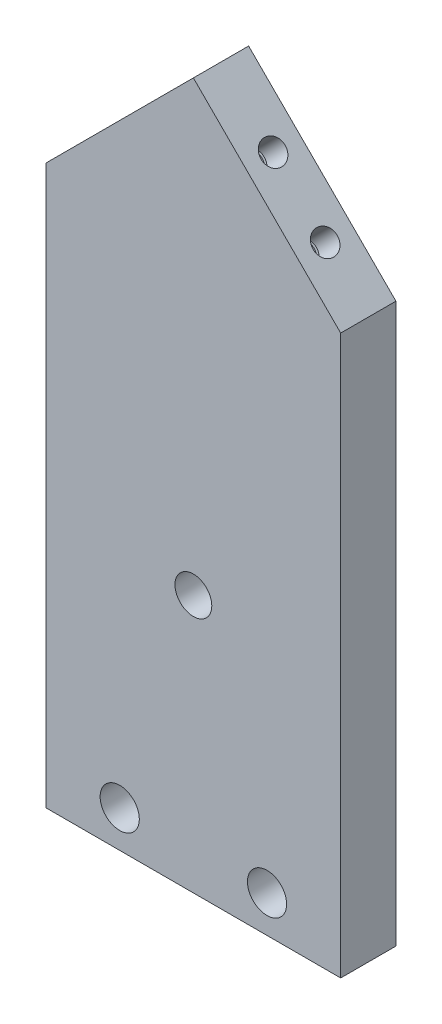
from build123d import *

# Parameters (mm, degrees)
BOSS_EXTRUDE2_DEPTH            = 9.525
F_1_4_CLEARANCE_HOLE1_D        = 6.7564
F_8_32_TAPPED_HOLE1_AT_2_COUNT = 2
F_8_32_TAPPED_HOLE1_AT_2_PITCH = 12.7
F_1_4_20_TAPPED_HOLE1_D        = 6.35


with BuildPart() as part:
    # Sketch1 → Boss-Extrude2 (new body)
    with BuildSketch(Plane.XY):
        Polygon((25.4, 121.11691189), (50.8, 95.71691189), (50.8, -0.584046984), (0, -0.584046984), (0, 95.71691189), align=None)
    extrude(amount=BOSS_EXTRUDE2_DEPTH)

    # 1_4 Clearance Hole1 (through all)
    with Locations(Plane.XY.offset(9.525)):
        with Locations((12.7, 5.765953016), (38.1, 5.765953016)):
            Hole(F_1_4_CLEARANCE_HOLE1_D / 2)

    # Sketch6 → 8-32 Tapped Hole1 (revolve, cut)
    with BuildSketch(Plane(origin=(16.419743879, 112.136655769, 4.7625), x_dir=(-0.7071067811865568, -0.7071067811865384, 0), z_dir=(0, 0, 1))):
        Polygon((0, 0), (0, 8.403806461), (1.7272, 7.366), (1.7272, 5.08), (2.0828, 5.08), (2.0828, 0), align=None)
    f_8_32_tapped_hole1 = revolve(axis=Axis((11.929615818, 116.62678383, 4.7625), (0.7071067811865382, -0.7071067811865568, 0)), mode=Mode.SUBTRACT)

    # 8-32 Tapped Hole1 at 2: 8-32 Tapped Hole1 ×2
    with Locations(*[Vector(-0.7071067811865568, -0.7071067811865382, 0) * (i * F_8_32_TAPPED_HOLE1_AT_2_PITCH) for i in range(1, F_8_32_TAPPED_HOLE1_AT_2_COUNT)]):
        add(f_8_32_tapped_hole1, mode=Mode.SUBTRACT)

    # Mirror1: 8-32 Tapped Hole1 across plane
    add(f_8_32_tapped_hole1.mirror(Plane(origin=(25.4, 0, 0), x_dir=(0, 0, 1), z_dir=(1, 0, 0))), mode=Mode.SUBTRACT)

    # Mirror1 copy 1 sketch → Mirror1 copy 1 (revolve, cut)
    with BuildSketch(Plane(origin=(43.360512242, 103.156399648, 4.7625), x_dir=(0.7071067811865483, -0.7071067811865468, 0), z_dir=(0, 0, 1))):
        Polygon((0, 0), (0, -8.403806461), (1.7272, -7.366), (1.7272, -5.08), (2.0828, -5.08), (2.0828, 0), align=None)
    revolve(axis=Axis((47.850640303, 107.646527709, 4.7625), (0.7071067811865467, 0.7071067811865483, 0)), mode=Mode.SUBTRACT)

    # 1_4-20 Tapped Hole1 (through all)
    with Locations(Plane.XY.offset(9.525)):
        with Locations((25.4, 43.865953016)):
            Hole(F_1_4_20_TAPPED_HOLE1_D / 2)


solid = part.part
